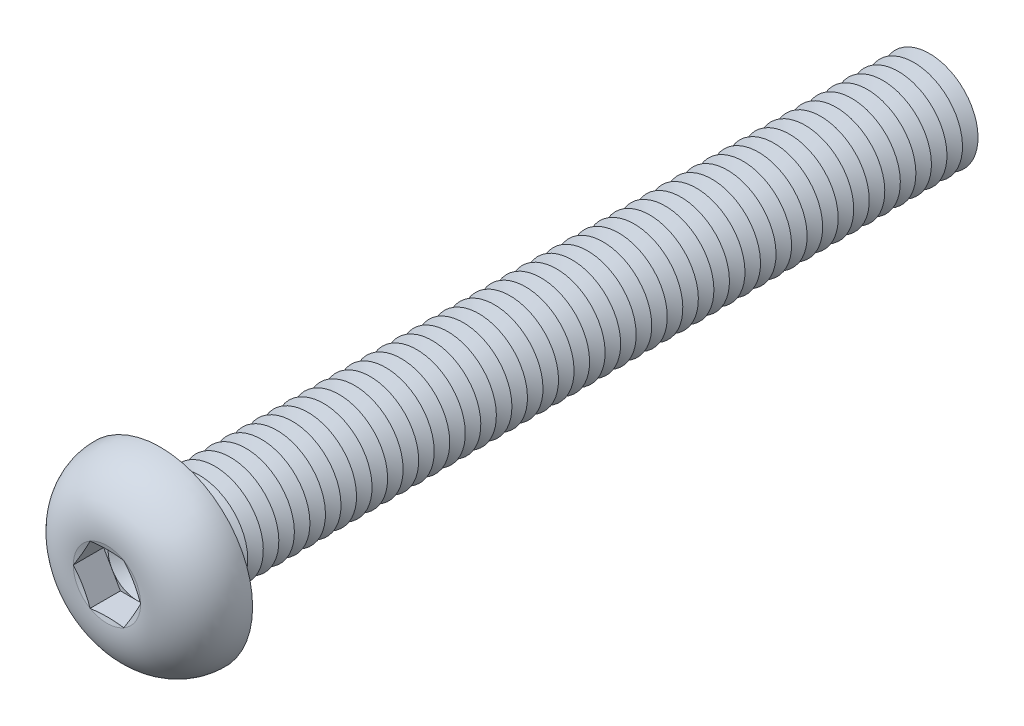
from build123d import *

# Parameters (mm, degrees)
FILLET1_R          = 0.4
LPATTERN1_COUNT    = 50
LPATTERN1_PITCH    = 0.8
CUT_EXTRUDE1_DEPTH = 1.56


with BuildPart() as part:
    # Sketch1 → Revolve1 (revolve)
    with BuildSketch(Plane(origin=(0, 0, 0), x_dir=(0, 0, -1), z_dir=(1, 0, 0))):
        with BuildLine():
            Line((0, 2.5), (0, 4.75))
            ThreePointArc((0, 4.75), (-2.041477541, 3.848329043), (-2.75, 1.73205))
            Line((-2.75, 1.73205), (-2.517949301, 0.866025))
            Line((-2.517949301, 0.866025), (-2.75, 0.866025))
            Line((-2.75, 0.866025), (-2.75, 0))
            Line((-2.75, 0), (40, 0))
            Line((40, 0), (40, 2.5))
            Line((40, 2.5), (0, 2.5))
        make_face()
    revolve(axis=Axis((0, 0, -40), (0, 0, 1)))

    # Fillet1
    fillet1_edges = [part.edges().sort_by_distance(p)[0] for p in [
        (0, -2.5, 0),
    ]]
    fillet(fillet1_edges, radius=FILLET1_R)

    # Sketch2 → Cut-Revolve1 (revolve, cut)
    with BuildSketch(Plane(origin=(0, 0, 0), x_dir=(0, 0, -1), z_dir=(1, 0, 0))):
        Polygon((39.6, 2.5), (40.4, 2.5), (40, 1.807179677), align=None)
    cut_revolve1 = revolve(axis=Axis((0, 0, -40), (0, 0, -1)), mode=Mode.SUBTRACT)

    # LPattern1: Cut-Revolve1 ×50
    with Locations(*[(0, 0, i * LPATTERN1_PITCH) for i in range(1, LPATTERN1_COUNT)]):
        add(cut_revolve1, mode=Mode.SUBTRACT)

    # Sketch3 → Cut-Extrude1 (cut)
    with BuildSketch(Plane.XY.offset(2.75)):
        Polygon((0.866025, 1.499999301), (-0.866025, 1.499999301), (-1.73205, 0), (-0.866025, -1.499999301), (0.866025, -1.499999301), (1.73205, 0), align=None)
    extrude(amount=-CUT_EXTRUDE1_DEPTH, mode=Mode.SUBTRACT)

    # Cut-Extrude2 cone 1 section (on through the dimple's axis) → Cut-Extrude2 (revolve, cut)
    with BuildSketch(Plane(origin=(0, 0, 1.19), x_dir=(0, -1, 0), z_dir=(1, 0, 0))):
        Polygon((0, 0), (1.499999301, 0), (0, 0.866025), align=None)
    revolve(axis=Axis((0, 0, 1.19), (0, 0, -1)), mode=Mode.SUBTRACT)


solid = part.part
